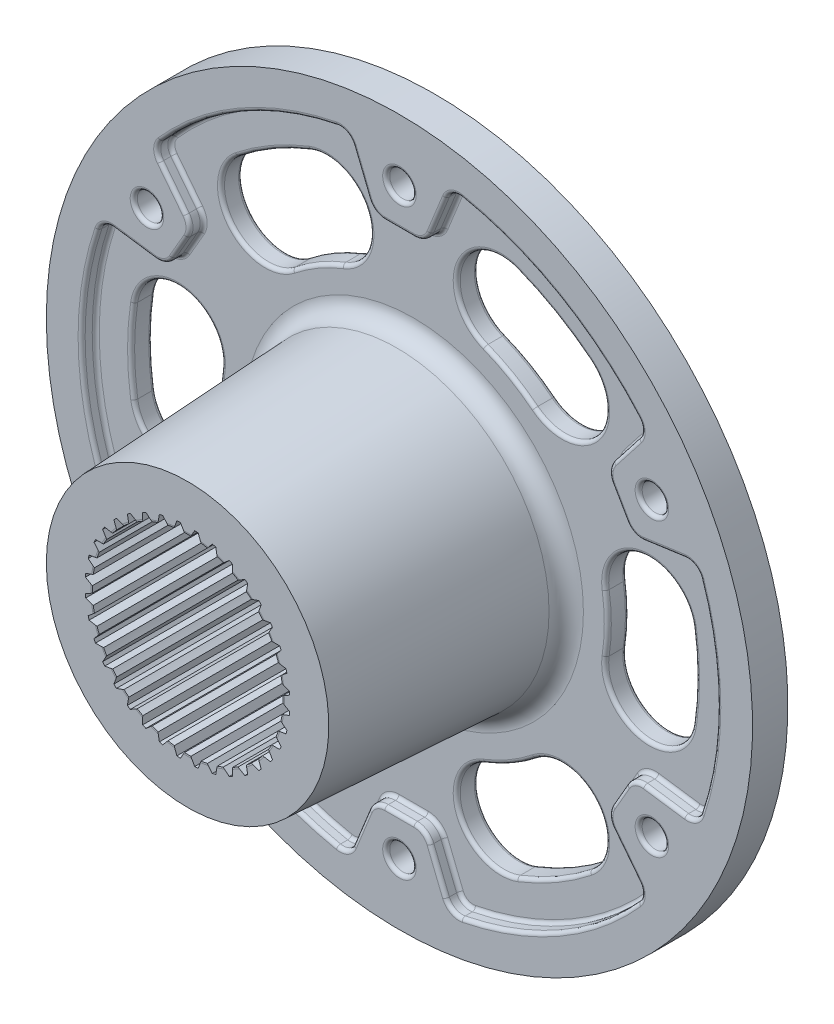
from build123d import *

# Parameters (mm, degrees)
BOSS_EXTRUDE1_REACH = 213.774
BOSS_EXTRUDE1_START = -70
SKETCH2_R           = 40
BOSS_EXTRUDE1_DRAFT = -3
BOSS_EXTRUDE3_REACH = 155.623
SKETCH5_R           = 3.75
CUT_EXTRUDE1_DEPTH  = 154.622914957
CIRPATTERN2_COUNT   = 6
CUT_EXTRUDE2_DEPTH  = 156.228863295
CIRPATTERN3_COUNT   = 6
SKETCH3_R           = 25.5
CUT_EXTRUDE11_DEPTH = 165.715659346
CUT_EXTRUDE11_DRAFT = -3
FILLET2_R           = 2
SKETCH41_R          = 27
CUT_EXTRUDE21_DEPTH = 158.797338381
CUT_EXTRUDE3_DEPTH  = 158.797338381
CIRPATTERN1_COUNT   = 36
FILLET3_R           = 4
FILLET5_R           = 5
FILLET4_R           = 1


with BuildPart() as part:
    # Sketch1 → Revolve1 (revolve)
    with BuildSketch(Plane(origin=(0, 0, 0), x_dir=(0, 0, -1), z_dir=(1, 0, 0)), mode=Mode.PRIVATE) as revolve1_sk:
        Polygon((0, 0), (0, 100), (-10, 100), (-10, 90), (-6, 90), (-6, 0), align=None)
    revolve(revolve1_sk.sketch.rotate(Axis((0, 0, 0), (0, 0, 1)), 90), axis=Axis((0, 0, 0), (0, 0, 1)))




with BuildPart() as boss_extrude1_long_prism_1:
    # Sketch2 → Boss-Extrude1 (the long prism of profile 1, to be tilted and cut off)
    with BuildSketch(Plane(origin=(0, 0, 0), x_dir=(-1, 0, 0), z_dir=(0, 0, -1)).offset(BOSS_EXTRUDE1_START)):
        Circle(SKETCH2_R)
    extrude(amount=BOSS_EXTRUDE1_REACH)
    boss_extrude1_tool1_sides = [boss_extrude1_long_prism_1.faces().sort_by_distance(p)[0] for p in [
        (40, 0, -36.887),
    ]]
    draft(boss_extrude1_tool1_sides, Plane(origin=(0, 0, 0), x_dir=(-1, 0, 0), z_dir=(0, 0, -1)).offset(BOSS_EXTRUDE1_START), BOSS_EXTRUDE1_DRAFT)  # the draft: side faces tilted about the start plane


with BuildPart() as part_1:
    add(part.part)
    boss_extrude1_tool1 = boss_extrude1_long_prism_1.part - part.part
    add(boss_extrude1_tool1.solids().sort_by_distance((0, 0, 70))[0])

    # Sketch4 → Boss-Extrude3 (add, up to next)
    with BuildSketch(Plane.XY.offset(10), mode=Mode.PRIVATE) as boss_extrude3_sk1:
        with BuildLine():
            Line((-14.38247559, 88.843370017), (-8.763376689, 74.935612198))
            ThreePointArc((-8.763376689, 74.935612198), (-6.923421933, 72.663457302), (-4.127457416, 71.808645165))
            Line((-4.127457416, 71.808645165), (4.127457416, 71.808645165))
            ThreePointArc((4.127457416, 71.808645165), (6.923421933, 72.663457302), (8.763376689, 74.935612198))
            Line((8.763376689, 74.935612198), (14.38247559, 88.843370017))
            ThreePointArc((14.38247559, 88.843370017), (0, 90), (-14.38247559, 88.843370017))
        make_face()
    boss_extrude3_tool1 = extrude(boss_extrude3_sk1.sketch, amount=-BOSS_EXTRUDE3_REACH, mode=Mode.PRIVATE) - part_1.part
    boss_extrude3 = boss_extrude3_tool1.solids().sort_by_distance((0, 81.769137, 10))[0]
    add(boss_extrude3)

    # Sketch5 → Cut-Extrude1 (cut, through all)
    with BuildSketch(Plane.XY.offset(10)):
        with Locations((0, 82.55)):
            Circle(SKETCH5_R)
    cut_extrude1 = extrude(amount=-CUT_EXTRUDE1_DEPTH, mode=Mode.SUBTRACT)

    # CirPattern2: Boss-Extrude3, Cut-Extrude1 ×6 about axis
    cirpattern2_axis = Axis((0, 0, 0), (0, 0, 1))
    add([boss_extrude3.rotate(cirpattern2_axis, i * 360 / CIRPATTERN2_COUNT) for i in range(1, CIRPATTERN2_COUNT)])
    add([cut_extrude1.rotate(cirpattern2_axis, i * 360 / CIRPATTERN2_COUNT) for i in range(1, CIRPATTERN2_COUNT)], mode=Mode.SUBTRACT)

    # Sketch6 → Cut-Extrude2 (cut, through all)
    with BuildSketch(Plane.XY.offset(6)):
        with BuildLine():
            ThreePointArc((34.253045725, 43.031719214), (51.81776503, 45.02687228), (49.822611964, 62.591591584))
            ThreePointArc((49.822611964, 62.591591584), (40, 69.282032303), (29.294602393, 74.443443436))
            ThreePointArc((29.294602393, 74.443443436), (13.085532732, 67.388937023), (20.140039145, 51.179867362))
            ThreePointArc((20.140039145, 51.179867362), (27.5, 47.631397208), (34.253045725, 43.031719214))
        make_face()
    cut_extrude2 = extrude(amount=-CUT_EXTRUDE2_DEPTH, mode=Mode.SUBTRACT)

    # CirPattern3: Cut-Extrude2 ×6 about axis
    cirpattern3_axis = Axis((0, 0, 0), (0, 0, 1))
    for i in range(1, CIRPATTERN3_COUNT):
        add(cut_extrude2.rotate(cirpattern3_axis, i * 360 / CIRPATTERN3_COUNT), mode=Mode.SUBTRACT)


with BuildPart() as cut_extrude11_tool:
    # Sketch3 → Cut-Extrude11 (with draft: the straight prism first)
    with BuildSketch(Plane(origin=(-8.011605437, -2.78492849, 70), x_dir=(1, 0, 0), z_dir=(0, 0, 1))):
        with Locations((8.011605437, 2.78492849)):
            Circle(SKETCH3_R)
    extrude(amount=-CUT_EXTRUDE11_DEPTH)
    # Cut-Extrude11: the draft: its side faces are tilted about the plane it starts from
    cut_extrude11_sides = [cut_extrude11_tool.faces().sort_by_distance(p)[0] for p in [
        (-25.5, 0, -12.857829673),
    ]]
    draft(cut_extrude11_sides, Plane(origin=(-8.011605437, -2.78492849, 70), x_dir=(1, 0, 0), z_dir=(0, 0, 1)), CUT_EXTRUDE11_DRAFT)


with BuildPart() as part_2:
    add(part_1.part)

    # Cut-Extrude11: cut by cut_extrude11_tool
    add(cut_extrude11_tool.part, mode=Mode.SUBTRACT)

    # Fillet2
    fillet2_edges = [part_2.edges().sort_by_distance(p)[0] for p in [
        (-25.5, 0, 70),
    ]]
    fillet(fillet2_edges, radius=FILLET2_R)

    # Sketch41 → Cut-Extrude21 (cut, through all)
    with BuildSketch(Plane.XY.offset(70)):
        Circle(SKETCH41_R)
    extrude(amount=-CUT_EXTRUDE21_DEPTH, mode=Mode.SUBTRACT)

    # Sketch51 → Cut-Extrude3 (cut, through all)
    with BuildSketch(Plane.XY.offset(70)):
        with BuildLine():
            Line((26.984775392, 0.906585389), (28.928929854, 2.029043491))
            ThreePointArc((28.928929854, 2.029043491), (28.889646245, 2.52751654), (28.841774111, 3.02523819))
            Line((28.841774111, 3.02523819), (26.73224292, 3.793044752))
            ThreePointArc((26.73224292, 3.793044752), (26.897256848, 2.353205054), (26.984775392, 0.906585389))
        make_face()
    cut_extrude3 = extrude(amount=-CUT_EXTRUDE3_DEPTH, mode=Mode.SUBTRACT)

    # CirPattern1: Cut-Extrude3 ×36 about axis
    cirpattern1_axis = Axis((0, 0, 0), (0, 0, 1))
    for i in range(1, CIRPATTERN1_COUNT):
        add(cut_extrude3.rotate(cirpattern1_axis, i * 360 / CIRPATTERN1_COUNT), mode=Mode.SUBTRACT)

    # Fillet3
    fillet3_edges = [part_2.edges().sort_by_distance(p)[0] for p in [
        (-84.131853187, 31.966095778, 8),
        (-69.749377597, 56.877274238, 8),
        (-14.38247559, 88.843370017, 8),
        (14.38247559, 88.843370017, 8),
        (69.749377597, 56.877274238, 8),
        (84.131853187, 31.966095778, 8),
        (84.131853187, -31.966095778, 8),
        (69.749377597, -56.877274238, 8),
        (14.38247559, -88.843370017, 8),
        (-14.38247559, -88.843370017, 8),
        (-69.749377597, -56.877274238, 8),
        (-84.131853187, -31.966095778, 8),
    ]]
    fillet(fillet3_edges, radius=FILLET3_R)

    # Fillet5
    fillet5_edges = [part_2.edges().sort_by_distance(p)[0] for p in [
        (43.354097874, 0, 6),
    ]]
    fillet(fillet5_edges, radius=FILLET5_R)

    # Fillet4
    fillet4_edges = [part_2.edges().sort_by_distance(p)[0] for p in [
        (-75.094071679, 30.695918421, 6),
        (-59.466688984, 42.327587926, 6),
        (-62.188110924, 35.904322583, 6),
        (-66.390110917, 30.335869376, 6),
        (-66.390110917, 30.335869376, 10),
        (-62.188110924, 35.904322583, 10),
        (-59.466688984, 42.327587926, 10),
        (-64.130480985, 49.685414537, 10),
        (-73.365397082, 38.027404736, 0),
        (-73.365397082, 38.027404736, 10),
        (-69.615397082, -44.522595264, 0),
        (-69.615397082, -44.522595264, 10),
        (3.75, -82.55, 0),
        (3.75, -82.55, 10),
        (73.365397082, -38.027404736, 0),
        (73.365397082, -38.027404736, 10),
        (69.615397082, 44.522595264, 0),
        (69.615397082, 44.522595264, 10),
        (13.085532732, 67.388937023, 0),
        (40, 69.282032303, 0),
        (51.81776503, 45.02687228, 0),
        (27.5, 47.631397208, 0),
        (13.085532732, 67.388937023, 6),
        (27.5, 47.631397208, 6),
        (51.81776503, 45.02687228, 6),
        (40, 69.282032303, 6),
        (-51.81776503, 45.02687228, 0),
        (-40, 69.282032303, 0),
        (-13.085532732, 67.388937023, 0),
        (-27.5, 47.631397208, 0),
        (-51.81776503, 45.02687228, 6),
        (-27.5, 47.631397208, 6),
        (-13.085532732, 67.388937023, 6),
        (-40, 69.282032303, 6),
        (-64.903297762, -22.362064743, 0),
        (-80, 0, 0),
        (-64.903297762, 22.362064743, 0),
        (-55, 0, 0),
        (-64.903297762, -22.362064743, 6),
        (-55, 0, 6),
        (-64.903297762, 22.362064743, 6),
        (-80, 0, 6),
        (-13.085532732, -67.388937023, 0),
        (-40, -69.282032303, 0),
        (-51.81776503, -45.02687228, 0),
        (-27.5, -47.631397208, 0),
        (-13.085532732, -67.388937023, 6),
        (-27.5, -47.631397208, 6),
        (-51.81776503, -45.02687228, 6),
        (-40, -69.282032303, 6),
        (51.81776503, -45.02687228, 0),
        (40, -69.282032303, 0),
        (13.085532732, -67.388937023, 0),
        (27.5, -47.631397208, 0),
        (51.81776503, -45.02687228, 6),
        (27.5, -47.631397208, 6),
        (13.085532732, -67.388937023, 6),
        (40, -69.282032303, 6),
        (64.903297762, 22.362064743, 0),
        (80, 0, 0),
        (64.903297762, -22.362064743, 0),
        (55, 0, 0),
        (64.903297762, 22.362064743, 6),
        (55, 0, 6),
        (64.903297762, -22.362064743, 6),
        (80, 0, 6),
        (-10.963590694, 80.381332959, 6),
        (6.923421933, 72.663457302, 6),
        (0, 71.808645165, 6),
        (-6.923421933, 72.663457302, 6),
        (-6.923421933, 72.663457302, 10),
        (0, 71.808645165, 10),
        (6.923421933, 72.663457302, 10),
        (10.963590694, 80.381332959, 10),
        (-3.75, 82.55, 0),
        (-3.75, 82.55, 10),
        (64.130480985, 49.685414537, 6),
        (66.390110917, 30.335869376, 6),
        (62.188110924, 35.904322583, 6),
        (59.466688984, 42.327587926, 6),
        (59.466688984, 42.327587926, 10),
        (62.188110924, 35.904322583, 10),
        (66.390110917, 30.335869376, 10),
        (75.094071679, 30.695918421, 10),
        (75.094071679, -30.695918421, 6),
        (59.466688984, -42.327587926, 6),
        (62.188110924, -35.904322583, 6),
        (66.390110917, -30.335869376, 6),
        (66.390110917, -30.335869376, 10),
        (62.188110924, -35.904322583, 10),
        (59.466688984, -42.327587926, 10),
        (64.130480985, -49.685414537, 10),
        (10.963590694, -80.381332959, 6),
        (-6.923421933, -72.663457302, 6),
        (0, -71.808645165, 6),
        (6.923421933, -72.663457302, 6),
        (6.923421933, -72.663457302, 10),
        (0, -71.808645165, 10),
        (-6.923421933, -72.663457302, 10),
        (-10.963590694, -80.381332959, 10),
        (-64.130480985, 49.685414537, 6),
        (-45, 77.942286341, 6),
        (-45, 77.942286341, 10),
        (-90, 0, 6),
        (-75.094071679, -30.695918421, 6),
        (-45, -77.942286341, 6),
        (-10.963590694, -80.381332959, 6),
        (45, -77.942286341, 6),
        (64.130480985, -49.685414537, 6),
        (90, 0, 6),
        (75.094071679, 30.695918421, 6),
        (45, 77.942286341, 6),
        (10.963590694, 80.381332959, 6),
        (14.973556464, -87.849118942, 6),
        (-83.566346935, 30.957079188, 6),
        (-83.566346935, -30.957079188, 6),
        (-68.592790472, -56.892039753, 6),
        (-14.973556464, -87.849118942, 6),
        (68.592790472, -56.892039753, 6),
        (83.566346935, -30.957079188, 6),
        (83.566346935, 30.957079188, 6),
        (68.592790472, 56.892039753, 6),
        (14.973556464, 87.849118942, 6),
        (-14.973556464, 87.849118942, 6),
        (-68.592790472, 56.892039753, 6),
        (-10.963590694, 80.381332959, 10),
        (45, 77.942286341, 10),
        (-64.130480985, -49.685414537, 6),
        (64.130480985, 49.685414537, 10),
        (90, 0, 10),
        (-66.390110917, -30.335869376, 6),
        (-62.188110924, -35.904322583, 6),
        (75.094071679, -30.695918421, 10),
        (-59.466688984, -42.327587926, 6),
        (45, -77.942286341, 10),
        (-45, -77.942286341, 10),
        (-64.130480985, -49.685414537, 10),
        (-90, 0, 10),
        (-75.094071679, 30.695918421, 10),
        (10.963590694, -80.381332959, 10),
        (-68.592790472, 56.892039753, 10),
        (-14.973556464, 87.849118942, 10),
        (14.973556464, 87.849118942, 10),
        (-59.466688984, -42.327587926, 10),
        (68.592790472, 56.892039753, 10),
        (83.566346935, 30.957079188, 10),
        (-62.188110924, -35.904322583, 10),
        (83.566346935, -30.957079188, 10),
        (68.592790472, -56.892039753, 10),
        (-14.973556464, -87.849118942, 10),
        (-66.390110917, -30.335869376, 10),
        (-68.592790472, -56.892039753, 10),
        (-83.566346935, -30.957079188, 10),
        (-83.566346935, 30.957079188, 10),
        (-75.094071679, -30.695918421, 10),
        (14.973556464, -87.849118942, 10),
    ]]
    fillet(fillet4_edges, radius=FILLET4_R)


solid = part_2.part
